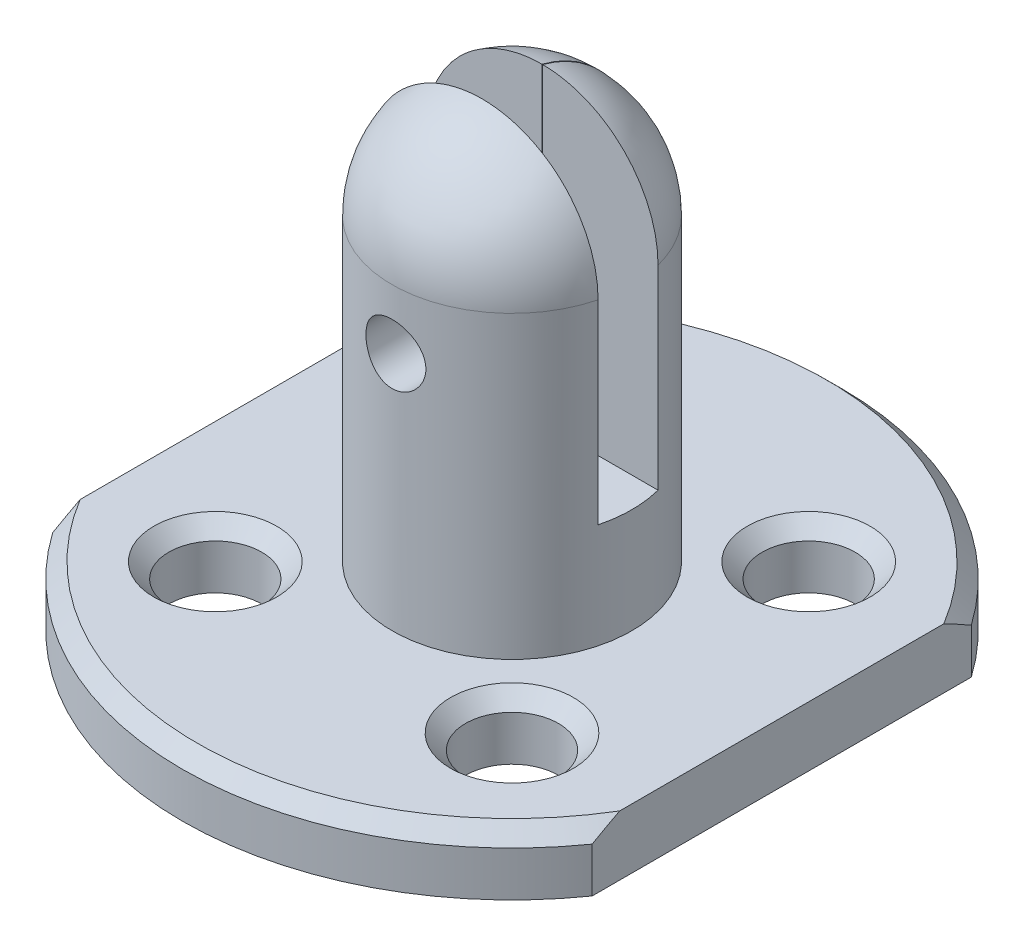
ISO-10303-21;
HEADER;
FILE_DESCRIPTION(('STEP AP214'),'2;1');
FILE_NAME('part.step','',(''),(''),'','','');
FILE_SCHEMA(('AUTOMOTIVE_DESIGN { 1 0 10303 214 1 1 1 1 }'));
ENDSEC;
DATA;
#1=APPLICATION_CONTEXT('core data for automotive mechanical design processes');
#2=APPLICATION_PROTOCOL_DEFINITION('international standard','automotive_design',2000,#1);
#3=PRODUCT_CONTEXT('',#1,'mechanical');
#4=PRODUCT('Part','Part','',(#3));
#5=PRODUCT_RELATED_PRODUCT_CATEGORY('part','',(#4));
#6=PRODUCT_DEFINITION_FORMATION('','',#4);
#7=PRODUCT_DEFINITION_CONTEXT('part definition',#1,'design');
#8=PRODUCT_DEFINITION('design','',#6,#7);
#9=PRODUCT_DEFINITION_SHAPE('','',#8);
#10=(LENGTH_UNIT() NAMED_UNIT(*) SI_UNIT(.MILLI.,.METRE.));
#11=(NAMED_UNIT(*) PLANE_ANGLE_UNIT() SI_UNIT($,.RADIAN.));
#12=(NAMED_UNIT(*) SI_UNIT($,.STERADIAN.) SOLID_ANGLE_UNIT());
#13=UNCERTAINTY_MEASURE_WITH_UNIT(LENGTH_MEASURE(1.E-05),#10,'distance_accuracy_value','');
#14=(GEOMETRIC_REPRESENTATION_CONTEXT(3) GLOBAL_UNCERTAINTY_ASSIGNED_CONTEXT((#13)) GLOBAL_UNIT_ASSIGNED_CONTEXT((#10,
#11,#12)) REPRESENTATION_CONTEXT('',''));
#15=CARTESIAN_POINT('',(0.,0.,0.));
#16=DIRECTION('',(0.,0.,1.));
#17=DIRECTION('',(1.,0.,0.));
#18=AXIS2_PLACEMENT_3D('',#15,#16,#17);
#19=CARTESIAN_POINT('',(0.,12.,0.));
#20=DIRECTION('',(-0.999847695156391,0.,-0.0174524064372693));
#21=DIRECTION('',(-0.0174524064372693,0.,0.999847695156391));
#22=AXIS2_PLACEMENT_3D('',#19,#20,#21);
#23=PLANE('',#22);
#24=CARTESIAN_POINT('',(0.,10.,0.));
#25=DIRECTION('',(-0.999847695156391,0.,-0.0174524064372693));
#26=DIRECTION('',(-0.0174524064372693,0.,0.999847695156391));
#27=AXIS2_PLACEMENT_3D('',#24,#25,#26);
#28=ELLIPSE('',#27,57.2986884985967,1.);
#29=CARTESIAN_POINT('',(0.0174550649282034,10.9998476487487,-1.));
#30=VERTEX_POINT('',#29);
#31=CARTESIAN_POINT('',(0.0698096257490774,10.9975603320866,-3.99939078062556));
#32=VERTEX_POINT('',#31);
#33=EDGE_CURVE('E436',#30,#32,#28,.T.);
#34=ORIENTED_EDGE('',*,*,#33,.F.);
#35=DIRECTION('',(0.,-1.,0.));
#36=VECTOR('',#35,1.);
#37=CARTESIAN_POINT('',(0.0174550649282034,12.,-1.));
#38=LINE('',#37,#36);
#39=CARTESIAN_POINT('',(0.0174550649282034,15.8729440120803,-1.));
#40=VERTEX_POINT('',#39);
#41=EDGE_CURVE('E464',#40,#30,#38,.T.);
#42=ORIENTED_EDGE('',*,*,#41,.F.);
#43=CARTESIAN_POINT('',(0.,12.,0.));
#44=DIRECTION('',(0.999847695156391,0.,0.0174524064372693));
#45=DIRECTION('',(-0.0174524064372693,0.,0.999847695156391));
#46=AXIS2_PLACEMENT_3D('',#43,#44,#45);
#47=CIRCLE('',#46,4.);
#48=CARTESIAN_POINT('',(0.0698096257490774,12.,-3.99939078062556));
#49=VERTEX_POINT('',#48);
#50=EDGE_CURVE('E443',#49,#40,#47,.T.);
#51=ORIENTED_EDGE('',*,*,#50,.F.);
#52=DIRECTION('',(0.,1.,0.));
#53=VECTOR('',#52,1.);
#54=CARTESIAN_POINT('',(0.0698096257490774,12.,-3.99939078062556));
#55=LINE('',#54,#53);
#56=EDGE_CURVE('E444',#32,#49,#55,.T.);
#57=ORIENTED_EDGE('',*,*,#56,.F.);
#58=EDGE_LOOP('',(#34,#42,#51,#57));
#59=FACE_BOUND('',#58,.T.);
#60=ADVANCED_FACE('F36',(#59),#23,.T.);
#61=CARTESIAN_POINT('',(0.,12.,0.));
#62=DIRECTION('',(-1.,0.,0.));
#63=DIRECTION('',(0.,0.,1.));
#64=AXIS2_PLACEMENT_3D('',#61,#62,#63);
#65=PLANE('',#64);
#66=DIRECTION('',(0.,1.,0.));
#67=VECTOR('',#66,1.);
#68=CARTESIAN_POINT('',(0.,12.,-4.));
#69=LINE('',#68,#67);
#70=CARTESIAN_POINT('',(0.,2.,-4.));
#71=VERTEX_POINT('',#70);
#72=CARTESIAN_POINT('',(0.,9.,-4.));
#73=VERTEX_POINT('',#72);
#74=EDGE_CURVE('E179',#71,#73,#69,.T.);
#75=ORIENTED_EDGE('',*,*,#74,.T.);
#76=DIRECTION('',(0.,0.,1.));
#77=VECTOR('',#76,1.);
#78=CARTESIAN_POINT('',(0.,9.,-5.));
#79=LINE('',#78,#77);
#80=CARTESIAN_POINT('',(0.,9.,-1.));
#81=VERTEX_POINT('',#80);
#82=EDGE_CURVE('E167',#73,#81,#79,.T.);
#83=ORIENTED_EDGE('',*,*,#82,.T.);
#84=DIRECTION('',(0.,-1.,0.));
#85=VECTOR('',#84,1.);
#86=CARTESIAN_POINT('',(0.,12.,-1.));
#87=LINE('',#86,#85);
#88=CARTESIAN_POINT('',(0.,5.5,-1.));
#89=VERTEX_POINT('',#88);
#90=EDGE_CURVE('E176',#81,#89,#87,.T.);
#91=ORIENTED_EDGE('',*,*,#90,.T.);
#92=DIRECTION('',(0.,0.,1.));
#93=VECTOR('',#92,1.);
#94=CARTESIAN_POINT('',(0.,5.5,0.));
#95=LINE('',#94,#93);
#96=CARTESIAN_POINT('',(0.,5.5,0.));
#97=VERTEX_POINT('',#96);
#98=EDGE_CURVE('E187',#89,#97,#95,.T.);
#99=ORIENTED_EDGE('',*,*,#98,.T.);
#100=DIRECTION('',(0.,-1.,0.));
#101=VECTOR('',#100,1.);
#102=CARTESIAN_POINT('',(0.,2.,0.));
#103=LINE('',#102,#101);
#104=CARTESIAN_POINT('',(0.,2.,0.));
#105=VERTEX_POINT('',#104);
#106=EDGE_CURVE('E447',#97,#105,#103,.T.);
#107=ORIENTED_EDGE('',*,*,#106,.T.);
#108=DIRECTION('',(0.,0.,-1.));
#109=VECTOR('',#108,1.);
#110=CARTESIAN_POINT('',(0.,2.,0.));
#111=LINE('',#110,#109);
#112=EDGE_CURVE('E210',#105,#71,#111,.T.);
#113=ORIENTED_EDGE('',*,*,#112,.T.);
#114=EDGE_LOOP('',(#75,#83,#91,#99,#107,#113));
#115=FACE_BOUND('',#114,.T.);
#116=ADVANCED_FACE('F174',(#115),#65,.F.);
#117=CARTESIAN_POINT('',(0.,12.,0.));
#118=DIRECTION('',(0.,-1.,0.));
#119=DIRECTION('',(0.0174524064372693,0.,-0.999847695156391));
#120=AXIS2_PLACEMENT_3D('',#117,#118,#119);
#121=SPHERICAL_SURFACE('',#120,4.);
#122=CARTESIAN_POINT('',(0.,12.,1.));
#123=DIRECTION('',(0.,0.,1.));
#124=DIRECTION('',(1.,0.,0.));
#125=AXIS2_PLACEMENT_3D('',#122,#123,#124);
#126=CIRCLE('',#125,3.87298334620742);
#127=CARTESIAN_POINT('',(-3.87298334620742,12.,1.));
#128=VERTEX_POINT('',#127);
#129=CARTESIAN_POINT('',(3.87298334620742,12.,1.));
#130=VERTEX_POINT('',#129);
#131=EDGE_CURVE('E199',#128,#130,#126,.F.);
#132=ORIENTED_EDGE('',*,*,#131,.F.);
#133=CARTESIAN_POINT('',(0.,12.,0.));
#134=DIRECTION('',(0.,-1.,0.));
#135=DIRECTION('',(0.,0.,-1.));
#136=AXIS2_PLACEMENT_3D('',#133,#134,#135);
#137=CIRCLE('',#136,4.);
#138=EDGE_CURVE('E209',#130,#128,#137,.T.);
#139=ORIENTED_EDGE('',*,*,#138,.F.);
#140=EDGE_LOOP('',(#132,#139));
#141=FACE_BOUND('',#140,.T.);
#142=ADVANCED_FACE('F208',(#141),#121,.T.);
#143=CARTESIAN_POINT('',(0.,12.,-1.));
#144=DIRECTION('',(0.,0.,-1.));
#145=DIRECTION('',(-1.,0.,0.));
#146=AXIS2_PLACEMENT_3D('',#143,#144,#145);
#147=CIRCLE('',#146,3.87298334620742);
#148=CARTESIAN_POINT('',(3.87298334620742,12.,-1.));
#149=VERTEX_POINT('',#148);
#150=EDGE_CURVE('E463',#149,#40,#147,.F.);
#151=ORIENTED_EDGE('',*,*,#150,.F.);
#152=EDGE_CURVE('E216',#49,#149,#137,.T.);
#153=ORIENTED_EDGE('',*,*,#152,.F.);
#154=ORIENTED_EDGE('',*,*,#50,.T.);
#155=EDGE_LOOP('',(#151,#153,#154));
#156=FACE_BOUND('',#155,.T.);
#157=ADVANCED_FACE('F335',(#156),#121,.T.);
#158=CARTESIAN_POINT('',(0.,2.,0.));
#159=DIRECTION('',(0.,-1.,0.));
#160=DIRECTION('',(0.,0.,-1.));
#161=AXIS2_PLACEMENT_3D('',#158,#159,#160);
#162=CYLINDRICAL_SURFACE('',#161,11.);
#163=DIRECTION('',(0.,1.,0.));
#164=VECTOR('',#163,1.);
#165=CARTESIAN_POINT('',(9.,0.,6.32455532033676));
#166=LINE('',#165,#164);
#167=CARTESIAN_POINT('',(9.,0.,6.32455532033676));
#168=VERTEX_POINT('',#167);
#169=CARTESIAN_POINT('',(9.,1.5,6.32455532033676));
#170=VERTEX_POINT('',#169);
#171=EDGE_CURVE('E238',#168,#170,#166,.T.);
#172=ORIENTED_EDGE('',*,*,#171,.T.);
#173=CARTESIAN_POINT('',(0.,1.5,0.));
#174=DIRECTION('',(0.,1.,0.));
#175=DIRECTION('',(0.,0.,1.));
#176=AXIS2_PLACEMENT_3D('',#173,#174,#175);
#177=CIRCLE('',#176,11.);
#178=CARTESIAN_POINT('',(-9.,1.5,6.32455532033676));
#179=VERTEX_POINT('',#178);
#180=EDGE_CURVE('E190',#170,#179,#177,.F.);
#181=ORIENTED_EDGE('',*,*,#180,.T.);
#182=DIRECTION('',(0.,1.,0.));
#183=VECTOR('',#182,1.);
#184=CARTESIAN_POINT('',(-9.,0.,6.32455532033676));
#185=LINE('',#184,#183);
#186=CARTESIAN_POINT('',(-9.,0.,6.32455532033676));
#187=VERTEX_POINT('',#186);
#188=EDGE_CURVE('E252',#187,#179,#185,.T.);
#189=ORIENTED_EDGE('',*,*,#188,.F.);
#190=CARTESIAN_POINT('',(0.,0.,0.));
#191=DIRECTION('',(0.,1.,0.));
#192=DIRECTION('',(0.,0.,1.));
#193=AXIS2_PLACEMENT_3D('',#190,#191,#192);
#194=CIRCLE('',#193,11.);
#195=EDGE_CURVE('E246',#187,#168,#194,.T.);
#196=ORIENTED_EDGE('',*,*,#195,.T.);
#197=EDGE_LOOP('',(#172,#181,#189,#196));
#198=FACE_BOUND('',#197,.T.);
#199=ADVANCED_FACE('F332',(#198),#162,.T.);
#200=DIRECTION('',(0.,1.,0.));
#201=VECTOR('',#200,1.);
#202=CARTESIAN_POINT('',(-9.,0.,-6.32455532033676));
#203=LINE('',#202,#201);
#204=CARTESIAN_POINT('',(-9.,0.,-6.32455532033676));
#205=VERTEX_POINT('',#204);
#206=CARTESIAN_POINT('',(-9.,1.5,-6.32455532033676));
#207=VERTEX_POINT('',#206);
#208=EDGE_CURVE('E242',#205,#207,#203,.T.);
#209=ORIENTED_EDGE('',*,*,#208,.T.);
#210=CARTESIAN_POINT('',(0.,1.5,0.));
#211=DIRECTION('',(0.,1.,0.));
#212=DIRECTION('',(0.,0.,1.));
#213=AXIS2_PLACEMENT_3D('',#210,#211,#212);
#214=CIRCLE('',#213,11.);
#215=CARTESIAN_POINT('',(9.,1.5,-6.32455532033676));
#216=VERTEX_POINT('',#215);
#217=EDGE_CURVE('E399',#207,#216,#214,.F.);
#218=ORIENTED_EDGE('',*,*,#217,.T.);
#219=DIRECTION('',(0.,1.,0.));
#220=VECTOR('',#219,1.);
#221=CARTESIAN_POINT('',(9.,0.,-6.32455532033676));
#222=LINE('',#221,#220);
#223=CARTESIAN_POINT('',(9.,0.,-6.32455532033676));
#224=VERTEX_POINT('',#223);
#225=EDGE_CURVE('E243',#224,#216,#222,.T.);
#226=ORIENTED_EDGE('',*,*,#225,.F.);
#227=EDGE_CURVE('E235',#224,#205,#194,.T.);
#228=ORIENTED_EDGE('',*,*,#227,.T.);
#229=EDGE_LOOP('',(#209,#218,#226,#228));
#230=FACE_BOUND('',#229,.T.);
#231=ADVANCED_FACE('F327',(#230),#162,.T.);
#232=CARTESIAN_POINT('',(0.,2.,0.));
#233=DIRECTION('',(0.,1.,0.));
#234=DIRECTION('',(0.,0.,1.));
#235=AXIS2_PLACEMENT_3D('',#232,#233,#234);
#236=PLANE('',#235);
#237=CARTESIAN_POINT('',(0.,2.,0.));
#238=DIRECTION('',(0.,-1.,0.));
#239=DIRECTION('',(0.,0.,-1.));
#240=AXIS2_PLACEMENT_3D('',#237,#238,#239);
#241=CIRCLE('',#240,4.);
#242=CARTESIAN_POINT('',(0.0698096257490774,2.,-3.99939078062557));
#243=VERTEX_POINT('',#242);
#244=EDGE_CURVE('E222',#243,#71,#241,.T.);
#245=ORIENTED_EDGE('',*,*,#244,.T.);
#246=ORIENTED_EDGE('',*,*,#112,.F.);
#247=DIRECTION('',(0.0174524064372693,0.,-0.999847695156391));
#248=VECTOR('',#247,1.);
#249=CARTESIAN_POINT('',(0.,2.,0.));
#250=LINE('',#249,#248);
#251=EDGE_CURVE('E449',#105,#243,#250,.T.);
#252=ORIENTED_EDGE('',*,*,#251,.T.);
#253=EDGE_LOOP('',(#245,#246,#252));
#254=FACE_BOUND('',#253,.T.);
#255=CARTESIAN_POINT('',(-4.94974746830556,2.,4.9497474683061));
#256=DIRECTION('',(0.,1.,0.));
#257=DIRECTION('',(0.,0.,1.));
#258=AXIS2_PLACEMENT_3D('',#255,#256,#257);
#259=CIRCLE('',#258,2.05000000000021);
#260=CARTESIAN_POINT('',(-4.94974746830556,2.,6.99974746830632));
#261=VERTEX_POINT('',#260);
#262=EDGE_CURVE('E282',#261,#261,#259,.F.);
#263=ORIENTED_EDGE('',*,*,#262,.T.);
#264=EDGE_LOOP('',(#263));
#265=FACE_BOUND('',#264,.T.);
#266=CARTESIAN_POINT('',(4.9497474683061,2.,4.94974746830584));
#267=DIRECTION('',(0.,1.,0.));
#268=DIRECTION('',(0.,0.,1.));
#269=AXIS2_PLACEMENT_3D('',#266,#267,#268);
#270=CIRCLE('',#269,2.04999999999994);
#271=CARTESIAN_POINT('',(4.9497474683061,2.,6.99974746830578));
#272=VERTEX_POINT('',#271);
#273=EDGE_CURVE('E279',#272,#272,#270,.F.);
#274=ORIENTED_EDGE('',*,*,#273,.T.);
#275=EDGE_LOOP('',(#274));
#276=FACE_BOUND('',#275,.T.);
#277=CARTESIAN_POINT('',(4.94974746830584,2.,-4.94974746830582));
#278=DIRECTION('',(0.,1.,0.));
#279=DIRECTION('',(0.,0.,1.));
#280=AXIS2_PLACEMENT_3D('',#277,#278,#279);
#281=CIRCLE('',#280,2.05);
#282=CARTESIAN_POINT('',(4.94974746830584,2.,-2.89974746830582));
#283=VERTEX_POINT('',#282);
#284=EDGE_CURVE('E276',#283,#283,#281,.F.);
#285=ORIENTED_EDGE('',*,*,#284,.T.);
#286=EDGE_LOOP('',(#285));
#287=FACE_BOUND('',#286,.T.);
#288=CARTESIAN_POINT('',(-4.94974746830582,2.,-4.94974746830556));
#289=DIRECTION('',(0.,1.,0.));
#290=DIRECTION('',(0.,0.,1.));
#291=AXIS2_PLACEMENT_3D('',#288,#289,#290);
#292=CIRCLE('',#291,2.05000000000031);
#293=CARTESIAN_POINT('',(-4.94974746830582,2.,-2.89974746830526));
#294=VERTEX_POINT('',#293);
#295=EDGE_CURVE('E273',#294,#294,#292,.F.);
#296=ORIENTED_EDGE('',*,*,#295,.T.);
#297=EDGE_LOOP('',(#296));
#298=FACE_BOUND('',#297,.T.);
#299=DIRECTION('',(0.,0.,-1.));
#300=VECTOR('',#299,1.);
#301=CARTESIAN_POINT('',(9.,2.,0.));
#302=LINE('',#301,#300);
#303=CARTESIAN_POINT('',(9.,2.,5.408326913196));
#304=VERTEX_POINT('',#303);
#305=CARTESIAN_POINT('',(9.,2.,-5.408326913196));
#306=VERTEX_POINT('',#305);
#307=EDGE_CURVE('E239',#304,#306,#302,.T.);
#308=ORIENTED_EDGE('',*,*,#307,.T.);
#309=CARTESIAN_POINT('',(0.,2.,0.));
#310=DIRECTION('',(0.,1.,0.));
#311=DIRECTION('',(0.,0.,1.));
#312=AXIS2_PLACEMENT_3D('',#309,#310,#311);
#313=CIRCLE('',#312,10.5);
#314=CARTESIAN_POINT('',(-9.,2.,-5.408326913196));
#315=VERTEX_POINT('',#314);
#316=EDGE_CURVE('E297',#306,#315,#313,.T.);
#317=ORIENTED_EDGE('',*,*,#316,.T.);
#318=DIRECTION('',(0.,0.,-1.));
#319=VECTOR('',#318,1.);
#320=CARTESIAN_POINT('',(-9.,2.,0.));
#321=LINE('',#320,#319);
#322=CARTESIAN_POINT('',(-9.,2.,5.408326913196));
#323=VERTEX_POINT('',#322);
#324=EDGE_CURVE('E229',#323,#315,#321,.T.);
#325=ORIENTED_EDGE('',*,*,#324,.F.);
#326=CARTESIAN_POINT('',(0.,2.,0.));
#327=DIRECTION('',(0.,1.,0.));
#328=DIRECTION('',(0.,0.,1.));
#329=AXIS2_PLACEMENT_3D('',#326,#327,#328);
#330=CIRCLE('',#329,10.5);
#331=EDGE_CURVE('E294',#323,#304,#330,.T.);
#332=ORIENTED_EDGE('',*,*,#331,.T.);
#333=EDGE_LOOP('',(#308,#317,#325,#332));
#334=FACE_BOUND('',#333,.T.);
#335=ADVANCED_FACE('F323',(#254,#265,#276,#287,#298,#334),#236,.T.);
#336=CARTESIAN_POINT('',(0.,0.,0.));
#337=DIRECTION('',(0.,1.,0.));
#338=DIRECTION('',(0.,0.,1.));
#339=AXIS2_PLACEMENT_3D('',#336,#337,#338);
#340=PLANE('',#339);
#341=CARTESIAN_POINT('',(-4.94974746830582,0.,-4.94974746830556));
#342=DIRECTION('',(0.,1.,0.));
#343=DIRECTION('',(0.,0.,1.));
#344=AXIS2_PLACEMENT_3D('',#341,#342,#343);
#345=CIRCLE('',#344,1.5500000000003);
#346=CARTESIAN_POINT('',(-4.94974746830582,0.,-3.39974746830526));
#347=VERTEX_POINT('',#346);
#348=EDGE_CURVE('E230',#347,#347,#345,.T.);
#349=ORIENTED_EDGE('',*,*,#348,.T.);
#350=EDGE_LOOP('',(#349));
#351=FACE_BOUND('',#350,.T.);
#352=CARTESIAN_POINT('',(-4.94974746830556,0.,4.9497474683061));
#353=DIRECTION('',(0.,1.,0.));
#354=DIRECTION('',(0.,0.,1.));
#355=AXIS2_PLACEMENT_3D('',#352,#353,#354);
#356=CIRCLE('',#355,1.55000000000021);
#357=CARTESIAN_POINT('',(-4.94974746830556,0.,6.49974746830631));
#358=VERTEX_POINT('',#357);
#359=EDGE_CURVE('E266',#358,#358,#356,.T.);
#360=ORIENTED_EDGE('',*,*,#359,.T.);
#361=EDGE_LOOP('',(#360));
#362=FACE_BOUND('',#361,.T.);
#363=CARTESIAN_POINT('',(4.9497474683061,0.,4.94974746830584));
#364=DIRECTION('',(0.,1.,0.));
#365=DIRECTION('',(0.,0.,1.));
#366=AXIS2_PLACEMENT_3D('',#363,#364,#365);
#367=CIRCLE('',#366,1.54999999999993);
#368=CARTESIAN_POINT('',(4.9497474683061,0.,6.49974746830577));
#369=VERTEX_POINT('',#368);
#370=EDGE_CURVE('E263',#369,#369,#367,.T.);
#371=ORIENTED_EDGE('',*,*,#370,.T.);
#372=EDGE_LOOP('',(#371));
#373=FACE_BOUND('',#372,.T.);
#374=CARTESIAN_POINT('',(4.94974746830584,0.,-4.94974746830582));
#375=DIRECTION('',(0.,1.,0.));
#376=DIRECTION('',(0.,0.,1.));
#377=AXIS2_PLACEMENT_3D('',#374,#375,#376);
#378=CIRCLE('',#377,1.55);
#379=CARTESIAN_POINT('',(4.94974746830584,0.,-3.39974746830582));
#380=VERTEX_POINT('',#379);
#381=EDGE_CURVE('E220',#380,#380,#378,.T.);
#382=ORIENTED_EDGE('',*,*,#381,.T.);
#383=EDGE_LOOP('',(#382));
#384=FACE_BOUND('',#383,.T.);
#385=CARTESIAN_POINT('',(0.,0.,0.));
#386=DIRECTION('',(0.,-1.,0.));
#387=DIRECTION('',(0.,0.,-1.));
#388=AXIS2_PLACEMENT_3D('',#385,#386,#387);
#389=CIRCLE('',#388,3.);
#390=CARTESIAN_POINT('',(0.,0.,-3.));
#391=VERTEX_POINT('',#390);
#392=EDGE_CURVE('E231',#391,#391,#389,.T.);
#393=ORIENTED_EDGE('',*,*,#392,.F.);
#394=EDGE_LOOP('',(#393));
#395=FACE_BOUND('',#394,.T.);
#396=DIRECTION('',(0.,0.,-1.));
#397=VECTOR('',#396,1.);
#398=CARTESIAN_POINT('',(9.,0.,0.));
#399=LINE('',#398,#397);
#400=EDGE_CURVE('E236',#168,#224,#399,.T.);
#401=ORIENTED_EDGE('',*,*,#400,.F.);
#402=ORIENTED_EDGE('',*,*,#195,.F.);
#403=DIRECTION('',(0.,0.,-1.));
#404=VECTOR('',#403,1.);
#405=CARTESIAN_POINT('',(-9.,0.,0.));
#406=LINE('',#405,#404);
#407=EDGE_CURVE('E249',#187,#205,#406,.T.);
#408=ORIENTED_EDGE('',*,*,#407,.T.);
#409=ORIENTED_EDGE('',*,*,#227,.F.);
#410=EDGE_LOOP('',(#401,#402,#408,#409));
#411=FACE_BOUND('',#410,.T.);
#412=ADVANCED_FACE('F319',(#351,#362,#373,#384,#395,#411),#340,.F.);
#413=CARTESIAN_POINT('',(-9.,0.,0.));
#414=DIRECTION('',(1.,0.,0.));
#415=DIRECTION('',(0.,0.,-1.));
#416=AXIS2_PLACEMENT_3D('',#413,#414,#415);
#417=PLANE('',#416);
#418=ORIENTED_EDGE('',*,*,#324,.T.);
#419=CARTESIAN_POINT('',(-9.,2.,-5.408326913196));
#420=CARTESIAN_POINT('',(-9.,1.9601636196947,-5.48566617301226));
#421=CARTESIAN_POINT('',(-9.,1.91983232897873,-5.56274968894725));
#422=CARTESIAN_POINT('',(-9.,1.8382408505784,-5.71641052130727));
#423=CARTESIAN_POINT('',(-9.,1.79698078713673,-5.79298790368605));
#424=CARTESIAN_POINT('',(-9.,1.71358246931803,-5.94566157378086));
#425=CARTESIAN_POINT('',(-9.,1.67144422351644,-6.02175786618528));
#426=CARTESIAN_POINT('',(-9.,1.5863337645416,-6.17349604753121));
#427=CARTESIAN_POINT('',(-9.,1.54336144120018,-6.24913787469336));
#428=CARTESIAN_POINT('',(-9.,1.50000000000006,-6.32455532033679));
#429=B_SPLINE_CURVE_WITH_KNOTS('',3,(#419,#420,#421,#422,#423,#424,#425,#426,#427,#428),
.UNSPECIFIED.,.F.,.F.,(4,2,2,2,4),(0.,0.260985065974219,0.521935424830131,0.782883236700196,
1.04386575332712),.UNSPECIFIED.);
#430=EDGE_CURVE('E307',#315,#207,#429,.T.);
#431=ORIENTED_EDGE('',*,*,#430,.T.);
#432=ORIENTED_EDGE('',*,*,#208,.F.);
#433=ORIENTED_EDGE('',*,*,#407,.F.);
#434=ORIENTED_EDGE('',*,*,#188,.T.);
#435=CARTESIAN_POINT('',(-9.,1.5,6.32455532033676));
#436=CARTESIAN_POINT('',(-9.,1.54336144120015,6.24913787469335));
#437=CARTESIAN_POINT('',(-9.,1.58633376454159,6.17349604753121));
#438=CARTESIAN_POINT('',(-9.,1.67144422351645,6.02175786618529));
#439=CARTESIAN_POINT('',(-9.,1.71358246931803,5.94566157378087));
#440=CARTESIAN_POINT('',(-9.,1.79698078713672,5.79298790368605));
#441=CARTESIAN_POINT('',(-9.,1.83824085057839,5.71641052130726));
#442=CARTESIAN_POINT('',(-9.,1.91983232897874,5.56274968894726));
#443=CARTESIAN_POINT('',(-9.,1.96016361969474,5.48566617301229));
#444=CARTESIAN_POINT('',(-9.,2.00000000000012,5.40832691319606));
#445=B_SPLINE_CURVE_WITH_KNOTS('',3,(#435,#436,#437,#438,#439,#440,#441,#442,#443,#444),
.UNSPECIFIED.,.F.,.F.,(4,2,2,2,4),(0.,0.260982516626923,0.52193032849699,0.7828806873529,
1.04386575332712),.UNSPECIFIED.);
#446=EDGE_CURVE('E300',#179,#323,#445,.T.);
#447=ORIENTED_EDGE('',*,*,#446,.T.);
#448=EDGE_LOOP('',(#418,#431,#432,#433,#434,#447));
#449=FACE_BOUND('',#448,.T.);
#450=ADVANCED_FACE('F313',(#449),#417,.F.);
#451=CARTESIAN_POINT('',(9.,0.,0.));
#452=DIRECTION('',(1.,0.,0.));
#453=DIRECTION('',(0.,0.,-1.));
#454=AXIS2_PLACEMENT_3D('',#451,#452,#453);
#455=PLANE('',#454);
#456=ORIENTED_EDGE('',*,*,#225,.T.);
#457=CARTESIAN_POINT('',(9.,1.5,-6.32455532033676));
#458=CARTESIAN_POINT('',(9.,1.54336144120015,-6.24913787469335));
#459=CARTESIAN_POINT('',(9.,1.58633376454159,-6.17349604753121));
#460=CARTESIAN_POINT('',(9.,1.67144422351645,-6.02175786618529));
#461=CARTESIAN_POINT('',(9.,1.71358246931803,-5.94566157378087));
#462=CARTESIAN_POINT('',(9.,1.79698078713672,-5.79298790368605));
#463=CARTESIAN_POINT('',(9.,1.83824085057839,-5.71641052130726));
#464=CARTESIAN_POINT('',(9.,1.91983232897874,-5.56274968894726));
#465=CARTESIAN_POINT('',(9.,1.96016361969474,-5.48566617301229));
#466=CARTESIAN_POINT('',(9.,2.00000000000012,-5.40832691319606));
#467=B_SPLINE_CURVE_WITH_KNOTS('',3,(#457,#458,#459,#460,#461,#462,#463,#464,#465,#466),
.UNSPECIFIED.,.F.,.F.,(4,2,2,2,4),(0.,0.260982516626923,0.52193032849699,0.7828806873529,
1.04386575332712),.UNSPECIFIED.);
#468=EDGE_CURVE('E374',#216,#306,#467,.T.);
#469=ORIENTED_EDGE('',*,*,#468,.T.);
#470=ORIENTED_EDGE('',*,*,#307,.F.);
#471=CARTESIAN_POINT('',(9.,2.,5.408326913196));
#472=CARTESIAN_POINT('',(9.,1.9601636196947,5.48566617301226));
#473=CARTESIAN_POINT('',(9.,1.91983232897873,5.56274968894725));
#474=CARTESIAN_POINT('',(9.,1.8382408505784,5.71641052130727));
#475=CARTESIAN_POINT('',(9.,1.79698078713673,5.79298790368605));
#476=CARTESIAN_POINT('',(9.,1.71358246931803,5.94566157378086));
#477=CARTESIAN_POINT('',(9.,1.67144422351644,6.02175786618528));
#478=CARTESIAN_POINT('',(9.,1.5863337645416,6.17349604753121));
#479=CARTESIAN_POINT('',(9.,1.54336144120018,6.24913787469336));
#480=CARTESIAN_POINT('',(9.,1.50000000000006,6.32455532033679));
#481=B_SPLINE_CURVE_WITH_KNOTS('',3,(#471,#472,#473,#474,#475,#476,#477,#478,#479,#480),
.UNSPECIFIED.,.F.,.F.,(4,2,2,2,4),(0.,0.260985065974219,0.521935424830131,0.782883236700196,
1.04386575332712),.UNSPECIFIED.);
#482=EDGE_CURVE('E380',#304,#170,#481,.T.);
#483=ORIENTED_EDGE('',*,*,#482,.T.);
#484=ORIENTED_EDGE('',*,*,#171,.F.);
#485=ORIENTED_EDGE('',*,*,#400,.T.);
#486=EDGE_LOOP('',(#456,#469,#470,#483,#484,#485));
#487=FACE_BOUND('',#486,.T.);
#488=ADVANCED_FACE('F318',(#487),#455,.T.);
#489=CARTESIAN_POINT('',(0.,-1.,0.));
#490=DIRECTION('',(0.,1.,0.));
#491=DIRECTION('',(0.,0.,1.));
#492=AXIS2_PLACEMENT_3D('',#489,#490,#491);
#493=CYLINDRICAL_SURFACE('',#492,3.);
#494=CARTESIAN_POINT('',(0.,-1.,0.));
#495=DIRECTION('',(0.,-1.,0.));
#496=DIRECTION('',(0.,0.,-1.));
#497=AXIS2_PLACEMENT_3D('',#494,#495,#496);
#498=CIRCLE('',#497,3.);
#499=CARTESIAN_POINT('',(0.,-1.,-3.));
#500=VERTEX_POINT('',#499);
#501=EDGE_CURVE('E226',#500,#500,#498,.T.);
#502=ORIENTED_EDGE('',*,*,#501,.F.);
#503=EDGE_LOOP('',(#502));
#504=FACE_BOUND('',#503,.T.);
#505=ORIENTED_EDGE('',*,*,#392,.T.);
#506=EDGE_LOOP('',(#505));
#507=FACE_BOUND('',#506,.T.);
#508=ADVANCED_FACE('F565',(#504,#507),#493,.T.);
#509=CARTESIAN_POINT('',(0.,-1.,0.));
#510=DIRECTION('',(0.,-1.,0.));
#511=DIRECTION('',(0.,0.,-1.));
#512=AXIS2_PLACEMENT_3D('',#509,#510,#511);
#513=PLANE('',#512);
#514=ORIENTED_EDGE('',*,*,#501,.T.);
#515=EDGE_LOOP('',(#514));
#516=FACE_BOUND('',#515,.T.);
#517=ADVANCED_FACE('F685',(#516),#513,.T.);
#518=CARTESIAN_POINT('',(4.94974746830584,-1.,-4.94974746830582));
#519=DIRECTION('',(0.,1.,0.));
#520=DIRECTION('',(0.,0.,1.));
#521=AXIS2_PLACEMENT_3D('',#518,#519,#520);
#522=CYLINDRICAL_SURFACE('',#521,1.55);
#523=CARTESIAN_POINT('',(4.94974746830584,1.5,-4.94974746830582));
#524=DIRECTION('',(0.,1.,0.));
#525=DIRECTION('',(0.,0.,1.));
#526=AXIS2_PLACEMENT_3D('',#523,#524,#525);
#527=CIRCLE('',#526,1.55);
#528=CARTESIAN_POINT('',(4.94974746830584,1.5,-3.39974746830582));
#529=VERTEX_POINT('',#528);
#530=EDGE_CURVE('E288',#529,#529,#527,.T.);
#531=ORIENTED_EDGE('',*,*,#530,.T.);
#532=EDGE_LOOP('',(#531));
#533=FACE_BOUND('',#532,.T.);
#534=ORIENTED_EDGE('',*,*,#381,.F.);
#535=EDGE_LOOP('',(#534));
#536=FACE_BOUND('',#535,.T.);
#537=ADVANCED_FACE('F690',(#533,#536),#522,.F.);
#538=CARTESIAN_POINT('',(4.9497474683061,-1.,4.94974746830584));
#539=DIRECTION('',(0.,1.,0.));
#540=DIRECTION('',(0.,0.,1.));
#541=AXIS2_PLACEMENT_3D('',#538,#539,#540);
#542=CYLINDRICAL_SURFACE('',#541,1.54999999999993);
#543=CARTESIAN_POINT('',(4.9497474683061,1.49999999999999,4.94974746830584));
#544=DIRECTION('',(0.,1.,0.));
#545=DIRECTION('',(0.,0.,1.));
#546=AXIS2_PLACEMENT_3D('',#543,#544,#545);
#547=CIRCLE('',#546,1.54999999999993);
#548=CARTESIAN_POINT('',(4.9497474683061,1.49999999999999,6.49974746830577));
#549=VERTEX_POINT('',#548);
#550=EDGE_CURVE('E285',#549,#549,#547,.T.);
#551=ORIENTED_EDGE('',*,*,#550,.T.);
#552=EDGE_LOOP('',(#551));
#553=FACE_BOUND('',#552,.T.);
#554=ORIENTED_EDGE('',*,*,#370,.F.);
#555=EDGE_LOOP('',(#554));
#556=FACE_BOUND('',#555,.T.);
#557=ADVANCED_FACE('F695',(#553,#556),#542,.F.);
#558=CARTESIAN_POINT('',(-4.94974746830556,-1.,4.9497474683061));
#559=DIRECTION('',(0.,1.,0.));
#560=DIRECTION('',(0.,0.,1.));
#561=AXIS2_PLACEMENT_3D('',#558,#559,#560);
#562=CYLINDRICAL_SURFACE('',#561,1.55000000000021);
#563=CARTESIAN_POINT('',(-4.94974746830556,1.49999999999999,4.9497474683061));
#564=DIRECTION('',(0.,1.,0.));
#565=DIRECTION('',(0.,0.,1.));
#566=AXIS2_PLACEMENT_3D('',#563,#564,#565);
#567=CIRCLE('',#566,1.55000000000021);
#568=CARTESIAN_POINT('',(-4.94974746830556,1.49999999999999,6.49974746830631));
#569=VERTEX_POINT('',#568);
#570=EDGE_CURVE('E234',#569,#569,#567,.T.);
#571=ORIENTED_EDGE('',*,*,#570,.T.);
#572=EDGE_LOOP('',(#571));
#573=FACE_BOUND('',#572,.T.);
#574=ORIENTED_EDGE('',*,*,#359,.F.);
#575=EDGE_LOOP('',(#574));
#576=FACE_BOUND('',#575,.T.);
#577=ADVANCED_FACE('F705',(#573,#576),#562,.F.);
#578=CARTESIAN_POINT('',(-4.94974746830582,-1.,-4.94974746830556));
#579=DIRECTION('',(0.,1.,0.));
#580=DIRECTION('',(0.,0.,1.));
#581=AXIS2_PLACEMENT_3D('',#578,#579,#580);
#582=CYLINDRICAL_SURFACE('',#581,1.5500000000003);
#583=CARTESIAN_POINT('',(-4.94974746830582,1.5,-4.94974746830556));
#584=DIRECTION('',(0.,1.,0.));
#585=DIRECTION('',(0.,0.,1.));
#586=AXIS2_PLACEMENT_3D('',#583,#584,#585);
#587=CIRCLE('',#586,1.5500000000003);
#588=CARTESIAN_POINT('',(-4.94974746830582,1.5,-3.39974746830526));
#589=VERTEX_POINT('',#588);
#590=EDGE_CURVE('E291',#589,#589,#587,.T.);
#591=ORIENTED_EDGE('',*,*,#590,.T.);
#592=EDGE_LOOP('',(#591));
#593=FACE_BOUND('',#592,.T.);
#594=ORIENTED_EDGE('',*,*,#348,.F.);
#595=EDGE_LOOP('',(#594));
#596=FACE_BOUND('',#595,.T.);
#597=ADVANCED_FACE('F345',(#593,#596),#582,.F.);
#598=CARTESIAN_POINT('',(-4.94974746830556,1.49999999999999,4.9497474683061));
#599=DIRECTION('',(0.,1.,0.));
#600=DIRECTION('',(0.,0.,1.));
#601=AXIS2_PLACEMENT_3D('',#598,#599,#600);
#602=CONICAL_SURFACE('',#601,1.55000000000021,0.78539816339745);
#603=ORIENTED_EDGE('',*,*,#262,.F.);
#604=EDGE_LOOP('',(#603));
#605=FACE_BOUND('',#604,.T.);
#606=ORIENTED_EDGE('',*,*,#570,.F.);
#607=EDGE_LOOP('',(#606));
#608=FACE_BOUND('',#607,.T.);
#609=ADVANCED_FACE('F338',(#605,#608),#602,.F.);
#610=CARTESIAN_POINT('',(4.9497474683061,1.49999999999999,4.94974746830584));
#611=DIRECTION('',(0.,1.,0.));
#612=DIRECTION('',(0.,0.,1.));
#613=AXIS2_PLACEMENT_3D('',#610,#611,#612);
#614=CONICAL_SURFACE('',#613,1.54999999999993,0.78539816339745);
#615=ORIENTED_EDGE('',*,*,#273,.F.);
#616=EDGE_LOOP('',(#615));
#617=FACE_BOUND('',#616,.T.);
#618=ORIENTED_EDGE('',*,*,#550,.F.);
#619=EDGE_LOOP('',(#618));
#620=FACE_BOUND('',#619,.T.);
#621=ADVANCED_FACE('F344',(#617,#620),#614,.F.);
#622=CARTESIAN_POINT('',(4.94974746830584,1.5,-4.94974746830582));
#623=DIRECTION('',(0.,1.,0.));
#624=DIRECTION('',(0.,0.,1.));
#625=AXIS2_PLACEMENT_3D('',#622,#623,#624);
#626=CONICAL_SURFACE('',#625,1.55,0.78539816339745);
#627=ORIENTED_EDGE('',*,*,#284,.F.);
#628=EDGE_LOOP('',(#627));
#629=FACE_BOUND('',#628,.T.);
#630=ORIENTED_EDGE('',*,*,#530,.F.);
#631=EDGE_LOOP('',(#630));
#632=FACE_BOUND('',#631,.T.);
#633=ADVANCED_FACE('F352',(#629,#632),#626,.F.);
#634=CARTESIAN_POINT('',(-4.94974746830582,1.5,-4.94974746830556));
#635=DIRECTION('',(0.,1.,0.));
#636=DIRECTION('',(0.,0.,1.));
#637=AXIS2_PLACEMENT_3D('',#634,#635,#636);
#638=CONICAL_SURFACE('',#637,1.5500000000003,0.785398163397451);
#639=ORIENTED_EDGE('',*,*,#295,.F.);
#640=EDGE_LOOP('',(#639));
#641=FACE_BOUND('',#640,.T.);
#642=ORIENTED_EDGE('',*,*,#590,.F.);
#643=EDGE_LOOP('',(#642));
#644=FACE_BOUND('',#643,.T.);
#645=ADVANCED_FACE('F359',(#641,#644),#638,.F.);
#646=CARTESIAN_POINT('',(0.,2.,0.));
#647=DIRECTION('',(0.,-1.,0.));
#648=DIRECTION('',(0.,0.,-1.));
#649=AXIS2_PLACEMENT_3D('',#646,#647,#648);
#650=CONICAL_SURFACE('',#649,10.5,0.785398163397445);
#651=ORIENTED_EDGE('',*,*,#468,.F.);
#652=ORIENTED_EDGE('',*,*,#217,.F.);
#653=ORIENTED_EDGE('',*,*,#430,.F.);
#654=ORIENTED_EDGE('',*,*,#316,.F.);
#655=EDGE_LOOP('',(#651,#652,#653,#654));
#656=FACE_BOUND('',#655,.T.);
#657=ADVANCED_FACE('F365',(#656),#650,.T.);
#658=CARTESIAN_POINT('',(0.,2.,0.));
#659=DIRECTION('',(0.,-1.,0.));
#660=DIRECTION('',(0.,0.,-1.));
#661=AXIS2_PLACEMENT_3D('',#658,#659,#660);
#662=CONICAL_SURFACE('',#661,10.5,0.785398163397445);
#663=ORIENTED_EDGE('',*,*,#446,.F.);
#664=ORIENTED_EDGE('',*,*,#180,.F.);
#665=ORIENTED_EDGE('',*,*,#482,.F.);
#666=ORIENTED_EDGE('',*,*,#331,.F.);
#667=EDGE_LOOP('',(#663,#664,#665,#666));
#668=FACE_BOUND('',#667,.T.);
#669=ADVANCED_FACE('F39',(#668),#662,.T.);
#670=CARTESIAN_POINT('',(0.,15.8729833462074,-1.));
#671=VERTEX_POINT('',#670);
#672=CARTESIAN_POINT('',(-3.87298334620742,12.,-1.));
#673=VERTEX_POINT('',#672);
#674=EDGE_CURVE('E469',#671,#673,#147,.F.);
#675=ORIENTED_EDGE('',*,*,#674,.F.);
#676=CARTESIAN_POINT('',(0.,12.,0.));
#677=DIRECTION('',(1.,0.,0.));
#678=DIRECTION('',(0.,0.,1.));
#679=AXIS2_PLACEMENT_3D('',#676,#677,#678);
#680=CIRCLE('',#679,4.);
#681=CARTESIAN_POINT('',(0.,12.,-4.));
#682=VERTEX_POINT('',#681);
#683=EDGE_CURVE('E455',#682,#671,#680,.T.);
#684=ORIENTED_EDGE('',*,*,#683,.F.);
#685=EDGE_CURVE('E217',#673,#682,#137,.T.);
#686=ORIENTED_EDGE('',*,*,#685,.F.);
#687=EDGE_LOOP('',(#675,#684,#686));
#688=FACE_BOUND('',#687,.T.);
#689=ADVANCED_FACE('F427',(#688),#121,.T.);
#690=CARTESIAN_POINT('',(0.,2.,0.));
#691=DIRECTION('',(0.,-1.,0.));
#692=DIRECTION('',(0.,0.,-1.));
#693=AXIS2_PLACEMENT_3D('',#690,#691,#692);
#694=CYLINDRICAL_SURFACE('',#693,4.);
#695=CARTESIAN_POINT('',(0.,9.,-4.));
#696=CARTESIAN_POINT('',(-0.0276766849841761,8.99999969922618,-4.00000157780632));
#697=CARTESIAN_POINT('',(-0.055339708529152,9.00114973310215,-3.99971239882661));
#698=CARTESIAN_POINT('',(-0.110459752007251,9.00573448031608,-3.99856932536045));
#699=CARTESIAN_POINT('',(-0.137916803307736,9.00916883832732,-3.99771551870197));
#700=CARTESIAN_POINT('',(-0.219572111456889,9.02284951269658,-3.99433848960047));
#701=CARTESIAN_POINT('',(-0.273210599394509,9.03647363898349,-3.99099947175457));
#702=CARTESIAN_POINT('',(-0.377351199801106,9.07229148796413,-3.98250473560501));
#703=CARTESIAN_POINT('',(-0.427853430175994,9.09448488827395,-3.97734908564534));
#704=CARTESIAN_POINT('',(-0.524436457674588,9.14678148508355,-3.96577019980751));
#705=CARTESIAN_POINT('',(-0.570516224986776,9.17688651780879,-3.95934666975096));
#706=CARTESIAN_POINT('',(-0.657866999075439,9.24479929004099,-3.94578302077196));
#707=CARTESIAN_POINT('',(-0.699034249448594,9.2827382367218,-3.938631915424));
#708=CARTESIAN_POINT('',(-0.774496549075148,9.36496483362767,-3.9244913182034));
#709=CARTESIAN_POINT('',(-0.808790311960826,9.40925366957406,-3.91750185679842));
#710=CARTESIAN_POINT('',(-0.870018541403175,9.50373138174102,-3.90436500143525));
#711=CARTESIAN_POINT('',(-0.896836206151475,9.55399808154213,-3.89823164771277));
#712=CARTESIAN_POINT('',(-0.94159885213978,9.65850173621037,-3.88766306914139));
#713=CARTESIAN_POINT('',(-0.959545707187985,9.71273784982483,-3.883227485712));
#714=CARTESIAN_POINT('',(-0.985703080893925,9.82249504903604,-3.87666988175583));
#715=CARTESIAN_POINT('',(-0.994101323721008,9.87796867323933,-3.87450332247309));
#716=CARTESIAN_POINT('',(-1.00150787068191,9.98957777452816,-3.87259574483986));
#717=CARTESIAN_POINT('',(-1.00051749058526,10.0457131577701,-3.87285438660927));
#718=CARTESIAN_POINT('',(-0.989324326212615,10.1556107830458,-3.87572804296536));
#719=CARTESIAN_POINT('',(-0.979345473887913,10.2093975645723,-3.87828577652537));
#720=CARTESIAN_POINT('',(-0.950815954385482,10.3145078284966,-3.88537810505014));
#721=CARTESIAN_POINT('',(-0.93226475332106,10.3658311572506,-3.88991282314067));
#722=CARTESIAN_POINT('',(-0.886926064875,10.4651592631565,-3.90050082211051));
#723=CARTESIAN_POINT('',(-0.86005719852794,10.5131252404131,-3.90656899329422));
#724=CARTESIAN_POINT('',(-0.798903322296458,10.6039468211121,-3.91953156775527));
#725=CARTESIAN_POINT('',(-0.764617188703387,10.6468016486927,-3.92642609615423));
#726=CARTESIAN_POINT('',(-0.688446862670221,10.7274644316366,-3.94050506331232));
#727=CARTESIAN_POINT('',(-0.646374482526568,10.7650944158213,-3.9476921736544));
#728=CARTESIAN_POINT('',(-0.556418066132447,10.8328073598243,-3.96137161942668));
#729=CARTESIAN_POINT('',(-0.508532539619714,10.8628883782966,-3.96786377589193));
#730=CARTESIAN_POINT('',(-0.408047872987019,10.914716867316,-3.97945529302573));
#731=CARTESIAN_POINT('',(-0.355430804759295,10.9364308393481,-3.98454903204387));
#732=CARTESIAN_POINT('',(-0.247168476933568,10.970628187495,-3.99272331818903));
#733=CARTESIAN_POINT('',(-0.19152778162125,10.9831250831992,-3.99580681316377));
#734=CARTESIAN_POINT('',(-0.112838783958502,10.9938724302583,-3.99847177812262));
#735=CARTESIAN_POINT('',(-0.0903170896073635,10.9961707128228,-3.99904410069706));
#736=CARTESIAN_POINT('',(-0.0452004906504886,10.9992327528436,-3.99980800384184));
#737=CARTESIAN_POINT('',(-0.0226057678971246,10.9999990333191,-4.00000021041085));
#738=CARTESIAN_POINT('',(0.,11.,-4.));
#739=B_SPLINE_CURVE_WITH_KNOTS('',3,(#695,#696,#697,#698,#699,#700,#701,#702,#703,#704,#705,
#706,#707,#708,#709,#710,#711,#712,#713,#714,#715,#716,#717,#718,#719,#720,#721,#722,#723,#724,
#725,#726,#727,#728,#729,#730,#731,#732,#733,#734,#735,#736,#737,#738),.UNSPECIFIED.,.F.,.F.,(4,
2,2,2,2,2,2,2,2,2,2,2,2,2,2,2,2,2,2,2,2,4),(0.,0.082977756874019,0.165942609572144,
0.331410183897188,0.496871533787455,0.662371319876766,0.830908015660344,0.999476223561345,
1.17054673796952,1.34158110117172,1.50919143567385,1.67677828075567,1.84030207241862,
2.00383604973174,2.16902348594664,2.33423596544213,2.50414213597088,2.67409195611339,
2.84471529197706,3.01508785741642,3.08298130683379,3.15076285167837),.UNSPECIFIED.);
#740=CARTESIAN_POINT('',(0.,11.,-4.));
#741=VERTEX_POINT('',#740);
#742=EDGE_CURVE('E180',#73,#741,#739,.T.);
#743=ORIENTED_EDGE('',*,*,#742,.F.);
#744=ORIENTED_EDGE('',*,*,#74,.F.);
#745=ORIENTED_EDGE('',*,*,#244,.F.);
#746=CARTESIAN_POINT('',(0.0698096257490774,9.00243966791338,-3.99939078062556));
#747=VERTEX_POINT('',#746);
#748=EDGE_CURVE('E432',#243,#747,#55,.T.);
#749=ORIENTED_EDGE('',*,*,#748,.T.);
#750=CARTESIAN_POINT('',(0.0698096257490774,10.9975603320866,-3.99939078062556));
#751=CARTESIAN_POINT('',(0.0975518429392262,10.9956192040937,-3.99890812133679));
#752=CARTESIAN_POINT('',(0.125193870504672,10.9925208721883,-3.99813496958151));
#753=CARTESIAN_POINT('',(0.180099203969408,10.9840408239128,-3.99603766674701));
#754=CARTESIAN_POINT('',(0.20736257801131,10.9786595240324,-3.994713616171));
#755=CARTESIAN_POINT('',(0.288183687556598,10.9591718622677,-3.98996838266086));
#756=CARTESIAN_POINT('',(0.340927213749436,10.9417106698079,-3.98577112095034));
#757=CARTESIAN_POINT('',(0.44263667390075,10.8984055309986,-3.97576313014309));
#758=CARTESIAN_POINT('',(0.491603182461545,10.872562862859,-3.96995264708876));
#759=CARTESIAN_POINT('',(0.584540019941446,10.8132354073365,-3.95733666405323));
#760=CARTESIAN_POINT('',(0.628509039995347,10.7797486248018,-3.95053090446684));
#761=CARTESIAN_POINT('',(0.711104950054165,10.70532224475,-3.93651132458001));
#762=CARTESIAN_POINT('',(0.749613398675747,10.6642521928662,-3.92929218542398));
#763=CARTESIAN_POINT('',(0.819247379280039,10.5761815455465,-3.91536688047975));
#764=CARTESIAN_POINT('',(0.850372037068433,10.5291802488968,-3.90866077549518));
#765=CARTESIAN_POINT('',(0.904551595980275,10.4301128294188,-3.89648132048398));
#766=CARTESIAN_POINT('',(0.927543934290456,10.3780112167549,-3.89101763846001));
#767=CARTESIAN_POINT('',(0.964389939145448,10.270514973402,-3.88205036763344));
#768=CARTESIAN_POINT('',(0.97824579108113,10.2151211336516,-3.87854631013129));
#769=CARTESIAN_POINT('',(0.996114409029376,10.1041026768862,-3.87399532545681));
#770=CARTESIAN_POINT('',(1.00036611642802,10.0485189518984,-3.87288877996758));
#771=CARTESIAN_POINT('',(0.99958449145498,9.93742522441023,-3.87309066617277));
#772=CARTESIAN_POINT('',(0.994552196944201,9.88191521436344,-3.87439882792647));
#773=CARTESIAN_POINT('',(0.975560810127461,9.77362032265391,-3.87922322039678));
#774=CARTESIAN_POINT('',(0.961769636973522,9.72080394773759,-3.88269789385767));
#775=CARTESIAN_POINT('',(0.925857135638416,9.61823828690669,-3.89141717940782));
#776=CARTESIAN_POINT('',(0.903734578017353,9.56848945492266,-3.89666205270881));
#777=CARTESIAN_POINT('',(0.85134631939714,9.47250483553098,-3.90844468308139));
#778=CARTESIAN_POINT('',(0.820944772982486,9.42634584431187,-3.91500347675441));
#779=CARTESIAN_POINT('',(0.753014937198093,9.33969676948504,-3.92863412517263));
#780=CARTESIAN_POINT('',(0.715485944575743,9.29920724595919,-3.93570603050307));
#781=CARTESIAN_POINT('',(0.633183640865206,9.22394056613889,-3.94979276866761));
#782=CARTESIAN_POINT('',(0.588245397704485,9.18934219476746,-3.95680117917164));
#783=CARTESIAN_POINT('',(0.493078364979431,9.12817781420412,-3.96978313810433));
#784=CARTESIAN_POINT('',(0.442850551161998,9.10161032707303,-3.97575687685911));
#785=CARTESIAN_POINT('',(0.339942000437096,9.05794441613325,-3.9858534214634));
#786=CARTESIAN_POINT('',(0.287372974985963,9.04059620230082,-3.99002441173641));
#787=CARTESIAN_POINT('',(0.206836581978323,9.02123229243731,-3.99474017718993));
#788=CARTESIAN_POINT('',(0.179676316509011,9.01588493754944,-3.99605597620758));
#789=CARTESIAN_POINT('',(0.124980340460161,9.00745517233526,-3.99814093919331));
#790=CARTESIAN_POINT('',(0.0974445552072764,9.00437321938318,-3.99890999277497));
#791=CARTESIAN_POINT('',(0.0698096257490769,9.00243966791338,-3.99939078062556));
#792=B_SPLINE_CURVE_WITH_KNOTS('',3,(#750,#751,#752,#753,#754,#755,#756,#757,#758,#759,#760,
#761,#762,#763,#764,#765,#766,#767,#768,#769,#770,#771,#772,#773,#774,#775,#776,#777,#778,#779,
#780,#781,#782,#783,#784,#785,#786,#787,#788,#789,#790,#791),.UNSPECIFIED.,.F.,.F.,(4,2,2,2,2,2,
2,2,2,2,2,2,2,2,2,2,2,2,2,2,4),(0.,0.0833894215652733,0.166763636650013,0.333052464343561,
0.499315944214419,0.665622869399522,0.835114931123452,1.0046270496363,1.17541624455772,
1.34616457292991,1.51261574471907,1.67904831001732,1.84238267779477,2.00574115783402,
2.17196097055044,2.33819719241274,2.50881694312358,2.67940527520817,2.8450996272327,
2.92815063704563,3.01121840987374),.UNSPECIFIED.);
#793=EDGE_CURVE('E440',#32,#747,#792,.T.);
#794=ORIENTED_EDGE('',*,*,#793,.F.);
#795=ORIENTED_EDGE('',*,*,#56,.T.);
#796=ORIENTED_EDGE('',*,*,#152,.T.);
#797=DIRECTION('',(0.,-1.,0.));
#798=VECTOR('',#797,1.);
#799=CARTESIAN_POINT('',(3.87298334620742,2.,-1.));
#800=LINE('',#799,#798);
#801=CARTESIAN_POINT('',(3.87298334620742,5.5,-1.));
#802=VERTEX_POINT('',#801);
#803=EDGE_CURVE('E211',#802,#149,#800,.F.);
#804=ORIENTED_EDGE('',*,*,#803,.F.);
#805=CARTESIAN_POINT('',(0.,5.5,0.));
#806=DIRECTION('',(0.,-1.,0.));
#807=DIRECTION('',(0.,0.,-1.));
#808=AXIS2_PLACEMENT_3D('',#805,#806,#807);
#809=CIRCLE('',#808,4.);
#810=CARTESIAN_POINT('',(3.87298334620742,5.5,1.));
#811=VERTEX_POINT('',#810);
#812=EDGE_CURVE('E472',#811,#802,#809,.F.);
#813=ORIENTED_EDGE('',*,*,#812,.F.);
#814=DIRECTION('',(0.,-1.,0.));
#815=VECTOR('',#814,1.);
#816=CARTESIAN_POINT('',(3.87298334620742,2.,1.));
#817=LINE('',#816,#815);
#818=EDGE_CURVE('E189',#130,#811,#817,.T.);
#819=ORIENTED_EDGE('',*,*,#818,.F.);
#820=ORIENTED_EDGE('',*,*,#138,.T.);
#821=DIRECTION('',(0.,-1.,0.));
#822=VECTOR('',#821,1.);
#823=CARTESIAN_POINT('',(-3.87298334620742,2.,1.));
#824=LINE('',#823,#822);
#825=CARTESIAN_POINT('',(-3.87298334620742,5.5,1.));
#826=VERTEX_POINT('',#825);
#827=EDGE_CURVE('E46',#826,#128,#824,.F.);
#828=ORIENTED_EDGE('',*,*,#827,.F.);
#829=CARTESIAN_POINT('',(-3.87298334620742,5.5,-1.));
#830=VERTEX_POINT('',#829);
#831=EDGE_CURVE('E471',#830,#826,#809,.F.);
#832=ORIENTED_EDGE('',*,*,#831,.F.);
#833=DIRECTION('',(0.,-1.,0.));
#834=VECTOR('',#833,1.);
#835=CARTESIAN_POINT('',(-3.87298334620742,2.,-1.));
#836=LINE('',#835,#834);
#837=EDGE_CURVE('E467',#673,#830,#836,.T.);
#838=ORIENTED_EDGE('',*,*,#837,.F.);
#839=ORIENTED_EDGE('',*,*,#685,.T.);
#840=EDGE_CURVE('E458',#741,#682,#69,.T.);
#841=ORIENTED_EDGE('',*,*,#840,.F.);
#842=EDGE_LOOP('',(#743,#744,#745,#749,#794,#795,#796,#804,#813,#819,#820,#828,#832,#838,#839,#841));
#843=FACE_BOUND('',#842,.T.);
#844=CARTESIAN_POINT('',(1.,10.,3.87298334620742));
#845=CARTESIAN_POINT('',(0.999998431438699,10.0552203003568,3.87298440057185));
#846=CARTESIAN_POINT('',(0.995410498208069,10.1104579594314,3.87417722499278));
#847=CARTESIAN_POINT('',(0.977209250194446,10.2193470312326,3.87880744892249));
#848=CARTESIAN_POINT('',(0.963590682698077,10.27299750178,3.8822461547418));
#849=CARTESIAN_POINT('',(0.927796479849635,10.3771214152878,3.89095489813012));
#850=CARTESIAN_POINT('',(0.905631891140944,10.4275988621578,3.8962225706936));
#851=CARTESIAN_POINT('',(0.853408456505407,10.5241243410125,3.90799276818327));
#852=CARTESIAN_POINT('',(0.823349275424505,10.5701721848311,3.91449534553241));
#853=CARTESIAN_POINT('',(0.755483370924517,10.6575446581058,3.92816286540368));
#854=CARTESIAN_POINT('',(0.717534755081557,10.6987574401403,3.93533839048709));
#855=CARTESIAN_POINT('',(0.635272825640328,10.7743045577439,3.94945150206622));
#856=CARTESIAN_POINT('',(0.590958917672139,10.8086382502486,3.95638906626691));
#857=CARTESIAN_POINT('',(0.496458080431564,10.8699101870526,3.96936166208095));
#858=CARTESIAN_POINT('',(0.446197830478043,10.8967385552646,3.975382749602));
#859=CARTESIAN_POINT('',(0.341705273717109,10.9415238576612,3.9857232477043));
#860=CARTESIAN_POINT('',(0.287473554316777,10.9594821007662,3.99004290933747));
#861=CARTESIAN_POINT('',(0.177743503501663,10.9856591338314,3.99641903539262));
#862=CARTESIAN_POINT('',(0.122293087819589,10.9940678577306,3.99851957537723));
#863=CARTESIAN_POINT('',(0.0107315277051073,11.0015033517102,4.00037437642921));
#864=CARTESIAN_POINT('',(-0.0453795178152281,11.0005315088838,4.00012898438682));
#865=CARTESIAN_POINT('',(-0.155352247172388,10.9893700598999,3.99735237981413));
#866=CARTESIAN_POINT('',(-0.209236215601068,10.9793854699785,3.99487200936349));
#867=CARTESIAN_POINT('',(-0.314538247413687,10.9508114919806,3.98796334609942));
#868=CARTESIAN_POINT('',(-0.365956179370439,10.932221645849,3.98353494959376));
#869=CARTESIAN_POINT('',(-0.465406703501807,10.8867989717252,3.97315003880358));
#870=CARTESIAN_POINT('',(-0.513404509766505,10.8598931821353,3.96718007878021));
#871=CARTESIAN_POINT('',(-0.604275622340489,10.7986577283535,3.95435961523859));
#872=CARTESIAN_POINT('',(-0.647148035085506,10.7643267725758,3.94750895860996));
#873=CARTESIAN_POINT('',(-0.727774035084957,10.6881165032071,3.93345485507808));
#874=CARTESIAN_POINT('',(-0.7653576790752,10.6460580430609,3.92624687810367));
#875=CARTESIAN_POINT('',(-0.832976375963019,10.5561600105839,3.91246017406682));
#876=CARTESIAN_POINT('',(-0.863011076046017,10.5083201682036,3.90588147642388));
#877=CARTESIAN_POINT('',(-0.914788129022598,10.4078839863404,3.89408198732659));
#878=CARTESIAN_POINT('',(-0.936489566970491,10.3552657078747,3.88886793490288));
#879=CARTESIAN_POINT('',(-0.970685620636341,10.2469658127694,3.88047456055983));
#880=CARTESIAN_POINT('',(-0.98318220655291,10.1912848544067,3.87729480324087));
#881=CARTESIAN_POINT('',(-0.998331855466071,10.0800161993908,3.87342142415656));
#882=CARTESIAN_POINT('',(-1.00123618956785,10.0244648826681,3.87266435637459));
#883=CARTESIAN_POINT('',(-0.997806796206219,9.91367122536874,3.87354937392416));
#884=CARTESIAN_POINT('',(-0.99147391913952,9.8584288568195,3.87519123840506));
#885=CARTESIAN_POINT('',(-0.969970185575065,9.75075429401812,3.88062832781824));
#886=CARTESIAN_POINT('',(-0.954945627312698,9.69829090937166,3.8843878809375));
#887=CARTESIAN_POINT('',(-0.916647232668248,9.59662741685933,3.89360287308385));
#888=CARTESIAN_POINT('',(-0.893372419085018,9.54742769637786,3.89905851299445));
#889=CARTESIAN_POINT('',(-0.838708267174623,9.45262348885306,3.91118454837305));
#890=CARTESIAN_POINT('',(-0.807168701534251,9.40710846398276,3.91787667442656));
#891=CARTESIAN_POINT('',(-0.737060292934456,9.32192465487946,3.93166833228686));
#892=CARTESIAN_POINT('',(-0.698490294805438,9.28225683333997,3.93876793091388));
#893=CARTESIAN_POINT('',(-0.614262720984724,9.20887558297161,3.95278961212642));
#894=CARTESIAN_POINT('',(-0.568451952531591,9.17533597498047,3.95970280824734));
#895=CARTESIAN_POINT('',(-0.471702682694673,9.1164256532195,3.97238886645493));
#896=CARTESIAN_POINT('',(-0.420764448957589,9.09105451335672,3.97816178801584));
#897=CARTESIAN_POINT('',(-0.315558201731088,9.04942158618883,3.98788046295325));
#898=CARTESIAN_POINT('',(-0.261317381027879,9.03309428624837,3.99183932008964));
#899=CARTESIAN_POINT('',(-0.150749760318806,9.00981586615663,3.99754117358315));
#900=CARTESIAN_POINT('',(-0.0944233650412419,9.00286293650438,3.99928459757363));
#901=CARTESIAN_POINT('',(0.0170835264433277,8.99863241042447,4.00034169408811));
#902=CARTESIAN_POINT('',(0.0722538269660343,9.00109829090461,3.99971978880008));
#903=CARTESIAN_POINT('',(0.181367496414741,9.01504782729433,3.99625896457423));
#904=CARTESIAN_POINT('',(0.235310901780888,9.0265312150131,3.99342011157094));
#905=CARTESIAN_POINT('',(0.340171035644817,9.05805221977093,3.98585432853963));
#906=CARTESIAN_POINT('',(0.391102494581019,9.07804345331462,3.98113764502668));
#907=CARTESIAN_POINT('',(0.488917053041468,9.12597057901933,3.97031288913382));
#908=CARTESIAN_POINT('',(0.535799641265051,9.15390747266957,3.96420464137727));
#909=CARTESIAN_POINT('',(0.625401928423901,9.21771523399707,3.95107249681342));
#910=CARTESIAN_POINT('',(0.667994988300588,9.25376014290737,3.94403016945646));
#911=CARTESIAN_POINT('',(0.746615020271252,9.33242285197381,3.92990649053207));
#912=CARTESIAN_POINT('',(0.782640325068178,9.37504231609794,3.92282512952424));
#913=CARTESIAN_POINT('',(0.84776202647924,9.46660141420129,3.90927475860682));
#914=CARTESIAN_POINT('',(0.876716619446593,9.51564412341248,3.90281963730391));
#915=CARTESIAN_POINT('',(0.925926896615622,9.61805548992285,3.8914395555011));
#916=CARTESIAN_POINT('',(0.946188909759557,9.67142096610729,3.88651348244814));
#917=CARTESIAN_POINT('',(0.974422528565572,9.77057701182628,3.87951908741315));
#918=CARTESIAN_POINT('',(0.983993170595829,9.81589316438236,3.87708663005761));
#919=CARTESIAN_POINT('',(0.99678229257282,9.90746886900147,3.87381838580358));
#920=CARTESIAN_POINT('',(1.00000131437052,9.95372834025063,3.87298246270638));
#921=CARTESIAN_POINT('',(1.,10.,3.87298334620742));
#922=B_SPLINE_CURVE_WITH_KNOTS('',3,(#844,#845,#846,#847,#848,#849,#850,#851,#852,#853,#854,
#855,#856,#857,#858,#859,#860,#861,#862,#863,#864,#865,#866,#867,#868,#869,#870,#871,#872,#873,
#874,#875,#876,#877,#878,#879,#880,#881,#882,#883,#884,#885,#886,#887,#888,#889,#890,#891,#892,
#893,#894,#895,#896,#897,#898,#899,#900,#901,#902,#903,#904,#905,#906,#907,#908,#909,#910,#911,
#912,#913,#914,#915,#916,#917,#918,#919,#920,#921),.UNSPECIFIED.,.T.,.F.,(4,2,2,2,2,2,2,2,2,2,2,
2,2,2,2,2,2,2,2,2,2,2,2,2,2,2,2,2,2,2,2,2,2,2,2,2,2,2,4),(0.,0.16549097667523,0.331078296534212,
0.496452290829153,0.661833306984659,0.830495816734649,0.999174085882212,1.17020598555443,
1.34121263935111,1.50875500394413,1.67627259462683,1.84007305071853,2.00388222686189,
2.16917149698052,2.3344895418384,2.50428186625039,2.67408212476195,2.84470572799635,
3.01529280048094,3.18137429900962,3.34744050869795,3.51078961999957,3.67415808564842,
3.84073138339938,4.00733207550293,4.17810132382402,4.34886166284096,4.51836829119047,
4.6878421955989,4.85273378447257,5.01762046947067,5.18161950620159,5.34563922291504,
5.51358838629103,5.68158012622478,5.85270590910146,6.02370688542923,6.16239130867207,
6.30106390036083),.UNSPECIFIED.);
#923=CARTESIAN_POINT('',(1.,10.,3.87298334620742));
#924=VERTEX_POINT('',#923);
#925=EDGE_CURVE('E478',#924,#924,#922,.T.);
#926=ORIENTED_EDGE('',*,*,#925,.F.);
#927=EDGE_LOOP('',(#926));
#928=FACE_BOUND('',#927,.T.);
#929=ADVANCED_FACE('F213',(#843,#928),#694,.T.);
#930=CARTESIAN_POINT('',(0.0174550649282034,9.00015235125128,-1.));
#931=VERTEX_POINT('',#930);
#932=EDGE_CURVE('E53',#747,#931,#28,.T.);
#933=ORIENTED_EDGE('',*,*,#932,.F.);
#934=ORIENTED_EDGE('',*,*,#748,.F.);
#935=ORIENTED_EDGE('',*,*,#251,.F.);
#936=ORIENTED_EDGE('',*,*,#106,.F.);
#937=DIRECTION('',(-0.0174524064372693,0.,0.999847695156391));
#938=VECTOR('',#937,1.);
#939=CARTESIAN_POINT('',(0.,5.5,0.));
#940=LINE('',#939,#938);
#941=CARTESIAN_POINT('',(0.0174550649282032,5.5,-1.));
#942=VERTEX_POINT('',#941);
#943=EDGE_CURVE('E474',#942,#97,#940,.T.);
#944=ORIENTED_EDGE('',*,*,#943,.F.);
#945=EDGE_CURVE('E435',#931,#942,#38,.T.);
#946=ORIENTED_EDGE('',*,*,#945,.F.);
#947=EDGE_LOOP('',(#933,#934,#935,#936,#944,#946));
#948=FACE_BOUND('',#947,.T.);
#949=ADVANCED_FACE('F411',(#948),#23,.T.);
#950=CARTESIAN_POINT('',(0.,11.,-1.));
#951=VERTEX_POINT('',#950);
#952=EDGE_CURVE('E186',#671,#951,#87,.T.);
#953=ORIENTED_EDGE('',*,*,#952,.T.);
#954=DIRECTION('',(0.,0.,1.));
#955=VECTOR('',#954,1.);
#956=CARTESIAN_POINT('',(0.,11.,-5.));
#957=LINE('',#956,#955);
#958=EDGE_CURVE('E61',#951,#741,#957,.F.);
#959=ORIENTED_EDGE('',*,*,#958,.T.);
#960=ORIENTED_EDGE('',*,*,#840,.T.);
#961=ORIENTED_EDGE('',*,*,#683,.T.);
#962=EDGE_LOOP('',(#953,#959,#960,#961));
#963=FACE_BOUND('',#962,.T.);
#964=ADVANCED_FACE('F416',(#963),#65,.F.);
#965=CARTESIAN_POINT('',(-5.,5.5,-1.));
#966=DIRECTION('',(0.,0.,-1.));
#967=DIRECTION('',(-1.,0.,0.));
#968=AXIS2_PLACEMENT_3D('',#965,#966,#967);
#969=PLANE('',#968);
#970=ORIENTED_EDGE('',*,*,#41,.T.);
#971=CARTESIAN_POINT('',(0.,10.,-1.));
#972=DIRECTION('',(0.,0.,-1.));
#973=DIRECTION('',(-1.,0.,0.));
#974=AXIS2_PLACEMENT_3D('',#971,#972,#973);
#975=CIRCLE('',#974,1.);
#976=EDGE_CURVE('E437',#30,#931,#975,.T.);
#977=ORIENTED_EDGE('',*,*,#976,.T.);
#978=ORIENTED_EDGE('',*,*,#945,.T.);
#979=DIRECTION('',(1.,0.,0.));
#980=VECTOR('',#979,1.);
#981=CARTESIAN_POINT('',(-5.,5.5,-1.));
#982=LINE('',#981,#980);
#983=EDGE_CURVE('E477',#942,#802,#982,.T.);
#984=ORIENTED_EDGE('',*,*,#983,.T.);
#985=ORIENTED_EDGE('',*,*,#803,.T.);
#986=ORIENTED_EDGE('',*,*,#150,.T.);
#987=EDGE_LOOP('',(#970,#977,#978,#984,#985,#986));
#988=FACE_BOUND('',#987,.T.);
#989=ADVANCED_FACE('F425',(#988),#969,.F.);
#990=CARTESIAN_POINT('',(-5.,5.5,1.));
#991=DIRECTION('',(0.,0.,1.));
#992=DIRECTION('',(1.,0.,0.));
#993=AXIS2_PLACEMENT_3D('',#990,#991,#992);
#994=PLANE('',#993);
#995=CARTESIAN_POINT('',(0.,10.,1.));
#996=DIRECTION('',(0.,0.,1.));
#997=DIRECTION('',(1.,0.,0.));
#998=AXIS2_PLACEMENT_3D('',#995,#996,#997);
#999=CIRCLE('',#998,1.);
#1000=CARTESIAN_POINT('',(1.,10.,1.));
#1001=VERTEX_POINT('',#1000);
#1002=EDGE_CURVE('E508',#1001,#1001,#999,.T.);
#1003=ORIENTED_EDGE('',*,*,#1002,.T.);
#1004=EDGE_LOOP('',(#1003));
#1005=FACE_BOUND('',#1004,.T.);
#1006=ORIENTED_EDGE('',*,*,#827,.T.);
#1007=ORIENTED_EDGE('',*,*,#131,.T.);
#1008=ORIENTED_EDGE('',*,*,#818,.T.);
#1009=DIRECTION('',(1.,0.,0.));
#1010=VECTOR('',#1009,1.);
#1011=CARTESIAN_POINT('',(-5.,5.5,1.));
#1012=LINE('',#1011,#1010);
#1013=EDGE_CURVE('E202',#826,#811,#1012,.T.);
#1014=ORIENTED_EDGE('',*,*,#1013,.F.);
#1015=EDGE_LOOP('',(#1006,#1007,#1008,#1014));
#1016=FACE_BOUND('',#1015,.T.);
#1017=ADVANCED_FACE('F198',(#1005,#1016),#994,.F.);
#1018=ORIENTED_EDGE('',*,*,#90,.F.);
#1019=CARTESIAN_POINT('',(0.,10.,-1.));
#1020=DIRECTION('',(0.,0.,-1.));
#1021=DIRECTION('',(-1.,0.,0.));
#1022=AXIS2_PLACEMENT_3D('',#1019,#1020,#1021);
#1023=CIRCLE('',#1022,1.);
#1024=EDGE_CURVE('E11',#81,#951,#1023,.T.);
#1025=ORIENTED_EDGE('',*,*,#1024,.T.);
#1026=ORIENTED_EDGE('',*,*,#952,.F.);
#1027=ORIENTED_EDGE('',*,*,#674,.T.);
#1028=ORIENTED_EDGE('',*,*,#837,.T.);
#1029=EDGE_CURVE('E185',#830,#89,#982,.T.);
#1030=ORIENTED_EDGE('',*,*,#1029,.T.);
#1031=EDGE_LOOP('',(#1018,#1025,#1026,#1027,#1028,#1030));
#1032=FACE_BOUND('',#1031,.T.);
#1033=ADVANCED_FACE('F183',(#1032),#969,.F.);
#1034=CARTESIAN_POINT('',(-5.,5.5,-1.));
#1035=DIRECTION('',(0.,-1.,0.));
#1036=DIRECTION('',(0.,0.,-1.));
#1037=AXIS2_PLACEMENT_3D('',#1034,#1035,#1036);
#1038=PLANE('',#1037);
#1039=ORIENTED_EDGE('',*,*,#831,.T.);
#1040=ORIENTED_EDGE('',*,*,#1013,.T.);
#1041=ORIENTED_EDGE('',*,*,#812,.T.);
#1042=ORIENTED_EDGE('',*,*,#983,.F.);
#1043=ORIENTED_EDGE('',*,*,#943,.T.);
#1044=ORIENTED_EDGE('',*,*,#98,.F.);
#1045=ORIENTED_EDGE('',*,*,#1029,.F.);
#1046=EDGE_LOOP('',(#1039,#1040,#1041,#1042,#1043,#1044,#1045));
#1047=FACE_BOUND('',#1046,.T.);
#1048=ADVANCED_FACE('F497',(#1047),#1038,.F.);
#1049=CARTESIAN_POINT('',(0.,10.,-5.));
#1050=DIRECTION('',(0.,0.,1.));
#1051=DIRECTION('',(1.,0.,0.));
#1052=AXIS2_PLACEMENT_3D('',#1049,#1050,#1051);
#1053=CYLINDRICAL_SURFACE('',#1052,1.);
#1054=ORIENTED_EDGE('',*,*,#742,.T.);
#1055=ORIENTED_EDGE('',*,*,#958,.F.);
#1056=ORIENTED_EDGE('',*,*,#1024,.F.);
#1057=ORIENTED_EDGE('',*,*,#82,.F.);
#1058=EDGE_LOOP('',(#1054,#1055,#1056,#1057));
#1059=FACE_BOUND('',#1058,.T.);
#1060=ADVANCED_FACE('F166',(#1059),#1053,.F.);
#1061=ORIENTED_EDGE('',*,*,#925,.T.);
#1062=EDGE_LOOP('',(#1061));
#1063=FACE_BOUND('',#1062,.T.);
#1064=ORIENTED_EDGE('',*,*,#1002,.F.);
#1065=EDGE_LOOP('',(#1064));
#1066=FACE_BOUND('',#1065,.T.);
#1067=ADVANCED_FACE('F496',(#1063,#1066),#1053,.F.);
#1068=ORIENTED_EDGE('',*,*,#793,.T.);
#1069=ORIENTED_EDGE('',*,*,#932,.T.);
#1070=ORIENTED_EDGE('',*,*,#976,.F.);
#1071=ORIENTED_EDGE('',*,*,#33,.T.);
#1072=EDGE_LOOP('',(#1068,#1069,#1070,#1071));
#1073=FACE_BOUND('',#1072,.T.);
#1074=ADVANCED_FACE('F498',(#1073),#1053,.F.);
#1075=CLOSED_SHELL('',(#60,#116,#142,#157,#199,#231,#335,#412,#450,#488,#508,#517,#537,#557,
#577,#597,#609,#621,#633,#645,#657,#669,#689,#929,#949,#964,#989,#1017,#1033,#1048,#1060,#1067,#1074));
#1076=MANIFOLD_SOLID_BREP('B2',#1075);
#1077=ADVANCED_BREP_SHAPE_REPRESENTATION('',(#18,#1076),#14);
#1078=SHAPE_DEFINITION_REPRESENTATION(#9,#1077);
ENDSEC;
END-ISO-10303-21;
